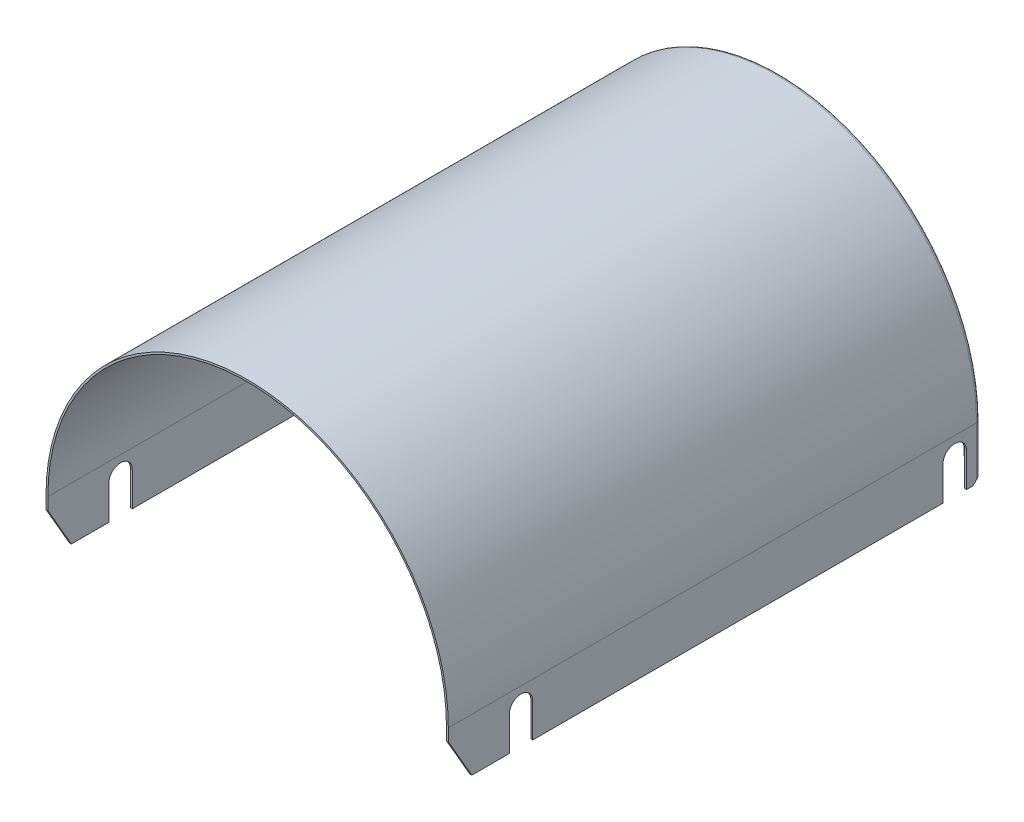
ISO-10303-21;
HEADER;
FILE_DESCRIPTION(('STEP AP214'),'2;1');
FILE_NAME('part.step','',(''),(''),'','','');
FILE_SCHEMA(('AUTOMOTIVE_DESIGN { 1 0 10303 214 1 1 1 1 }'));
ENDSEC;
DATA;
#1=APPLICATION_CONTEXT('core data for automotive mechanical design processes');
#2=APPLICATION_PROTOCOL_DEFINITION('international standard','automotive_design',2000,#1);
#3=PRODUCT_CONTEXT('',#1,'mechanical');
#4=PRODUCT('Part','Part','',(#3));
#5=PRODUCT_RELATED_PRODUCT_CATEGORY('part','',(#4));
#6=PRODUCT_DEFINITION_FORMATION('','',#4);
#7=PRODUCT_DEFINITION_CONTEXT('part definition',#1,'design');
#8=PRODUCT_DEFINITION('design','',#6,#7);
#9=PRODUCT_DEFINITION_SHAPE('','',#8);
#10=(LENGTH_UNIT() NAMED_UNIT(*) SI_UNIT(.MILLI.,.METRE.));
#11=(NAMED_UNIT(*) PLANE_ANGLE_UNIT() SI_UNIT($,.RADIAN.));
#12=(NAMED_UNIT(*) SI_UNIT($,.STERADIAN.) SOLID_ANGLE_UNIT());
#13=UNCERTAINTY_MEASURE_WITH_UNIT(LENGTH_MEASURE(1.E-05),#10,'distance_accuracy_value','');
#14=(GEOMETRIC_REPRESENTATION_CONTEXT(3) GLOBAL_UNCERTAINTY_ASSIGNED_CONTEXT((#13)) GLOBAL_UNIT_ASSIGNED_CONTEXT((#10,
#11,#12)) REPRESENTATION_CONTEXT('',''));
#15=CARTESIAN_POINT('',(0.,0.,0.));
#16=DIRECTION('',(0.,0.,1.));
#17=DIRECTION('',(1.,0.,0.));
#18=AXIS2_PLACEMENT_3D('',#15,#16,#17);
#19=CARTESIAN_POINT('',(0.,0.,0.));
#20=DIRECTION('',(0.,0.,1.));
#21=DIRECTION('',(1.,0.,0.));
#22=AXIS2_PLACEMENT_3D('',#19,#20,#21);
#23=PLANE('',#22);
#24=DIRECTION('',(0.,1.,0.));
#25=VECTOR('',#24,1.);
#26=CARTESIAN_POINT('',(-84.3,-22.5,0.));
#27=LINE('',#26,#25);
#28=CARTESIAN_POINT('',(-84.3,0.,0.));
#29=VERTEX_POINT('',#28);
#30=CARTESIAN_POINT('',(-84.3,-20.3,0.));
#31=VERTEX_POINT('',#30);
#32=EDGE_CURVE('E470',#29,#31,#27,.F.);
#33=ORIENTED_EDGE('',*,*,#32,.T.);
#34=DIRECTION('',(0.683941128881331,0.729537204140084,0.));
#35=VECTOR('',#34,1.);
#36=CARTESIAN_POINT('',(-34.7376299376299,32.566528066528,0.));
#37=LINE('',#36,#35);
#38=CARTESIAN_POINT('',(-79.8,-15.5,0.));
#39=VERTEX_POINT('',#38);
#40=EDGE_CURVE('E288',#31,#39,#37,.T.);
#41=ORIENTED_EDGE('',*,*,#40,.T.);
#42=DIRECTION('',(0.,1.,0.));
#43=VECTOR('',#42,1.);
#44=CARTESIAN_POINT('',(-79.8,-22.5,0.));
#45=LINE('',#44,#43);
#46=CARTESIAN_POINT('',(-79.8,0.,0.));
#47=VERTEX_POINT('',#46);
#48=EDGE_CURVE('E287',#39,#47,#45,.T.);
#49=ORIENTED_EDGE('',*,*,#48,.T.);
#50=CARTESIAN_POINT('',(0.,0.,0.));
#51=DIRECTION('',(0.,0.,-1.));
#52=DIRECTION('',(1.,0.,0.));
#53=AXIS2_PLACEMENT_3D('',#50,#51,#52);
#54=CIRCLE('',#53,79.8);
#55=CARTESIAN_POINT('',(79.8,0.,0.));
#56=VERTEX_POINT('',#55);
#57=EDGE_CURVE('E300',#47,#56,#54,.T.);
#58=ORIENTED_EDGE('',*,*,#57,.T.);
#59=DIRECTION('',(0.,-1.,0.));
#60=VECTOR('',#59,1.);
#61=CARTESIAN_POINT('',(79.8,-22.5,0.));
#62=LINE('',#61,#60);
#63=CARTESIAN_POINT('',(79.8,-15.5,0.));
#64=VERTEX_POINT('',#63);
#65=EDGE_CURVE('E295',#56,#64,#62,.T.);
#66=ORIENTED_EDGE('',*,*,#65,.T.);
#67=DIRECTION('',(-0.683941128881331,0.729537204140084,0.));
#68=VECTOR('',#67,1.);
#69=CARTESIAN_POINT('',(34.7376299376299,32.566528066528,0.));
#70=LINE('',#69,#68);
#71=CARTESIAN_POINT('',(84.3,-20.3,0.));
#72=VERTEX_POINT('',#71);
#73=EDGE_CURVE('E535',#72,#64,#70,.T.);
#74=ORIENTED_EDGE('',*,*,#73,.F.);
#75=DIRECTION('',(0.,1.,0.));
#76=VECTOR('',#75,1.);
#77=CARTESIAN_POINT('',(84.3,0.,0.));
#78=LINE('',#77,#76);
#79=CARTESIAN_POINT('',(84.3,0.,0.));
#80=VERTEX_POINT('',#79);
#81=EDGE_CURVE('E468',#72,#80,#78,.T.);
#82=ORIENTED_EDGE('',*,*,#81,.T.);
#83=CARTESIAN_POINT('',(0.,0.,0.));
#84=DIRECTION('',(0.,0.,1.));
#85=DIRECTION('',(1.,0.,0.));
#86=AXIS2_PLACEMENT_3D('',#83,#84,#85);
#87=CIRCLE('',#86,84.3);
#88=EDGE_CURVE('E466',#80,#29,#87,.T.);
#89=ORIENTED_EDGE('',*,*,#88,.T.);
#90=EDGE_LOOP('',(#33,#41,#49,#58,#66,#74,#82,#89));
#91=FACE_BOUND('',#90,.T.);
#92=ADVANCED_FACE('F32',(#91),#23,.T.);
#93=CARTESIAN_POINT('',(-79.8,-22.5,-0.799999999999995));
#94=DIRECTION('',(1.,0.,0.));
#95=DIRECTION('',(0.,0.,-1.));
#96=AXIS2_PLACEMENT_3D('',#93,#94,#95);
#97=PLANE('',#96);
#98=ORIENTED_EDGE('',*,*,#48,.F.);
#99=DIRECTION('',(0.,0.,-1.));
#100=VECTOR('',#99,1.);
#101=CARTESIAN_POINT('',(-79.8,-15.5,226.));
#102=LINE('',#101,#100);
#103=CARTESIAN_POINT('',(-79.8,-15.5,-0.799999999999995));
#104=VERTEX_POINT('',#103);
#105=EDGE_CURVE('E273',#39,#104,#102,.T.);
#106=ORIENTED_EDGE('',*,*,#105,.T.);
#107=DIRECTION('',(0.,1.,0.));
#108=VECTOR('',#107,1.);
#109=CARTESIAN_POINT('',(-79.8,-22.5,-0.799999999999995));
#110=LINE('',#109,#108);
#111=CARTESIAN_POINT('',(-79.8,0.,-0.799999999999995));
#112=VERTEX_POINT('',#111);
#113=EDGE_CURVE('E285',#104,#112,#110,.T.);
#114=ORIENTED_EDGE('',*,*,#113,.T.);
#115=DIRECTION('',(0.,0.,1.));
#116=VECTOR('',#115,1.);
#117=CARTESIAN_POINT('',(-79.8,0.,-0.799999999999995));
#118=LINE('',#117,#116);
#119=EDGE_CURVE('E308',#112,#47,#118,.T.);
#120=ORIENTED_EDGE('',*,*,#119,.T.);
#121=EDGE_LOOP('',(#98,#106,#114,#120));
#122=FACE_BOUND('',#121,.T.);
#123=ADVANCED_FACE('F283',(#122),#97,.T.);
#124=CARTESIAN_POINT('',(0.,0.,-0.799999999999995));
#125=DIRECTION('',(0.,0.,1.));
#126=DIRECTION('',(1.,0.,0.));
#127=AXIS2_PLACEMENT_3D('',#124,#125,#126);
#128=PLANE('',#127);
#129=DIRECTION('',(-0.68394112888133,-0.729537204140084,0.));
#130=VECTOR('',#129,1.);
#131=CARTESIAN_POINT('',(-84.3,-20.3,-0.799999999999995));
#132=LINE('',#131,#130);
#133=CARTESIAN_POINT('',(-83.55,-19.5,-0.799999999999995));
#134=VERTEX_POINT('',#133);
#135=EDGE_CURVE('E270',#104,#134,#132,.T.);
#136=ORIENTED_EDGE('',*,*,#135,.T.);
#137=DIRECTION('',(1.,0.,0.));
#138=VECTOR('',#137,1.);
#139=CARTESIAN_POINT('',(-85.8,-19.5,-0.799999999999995));
#140=LINE('',#139,#138);
#141=CARTESIAN_POINT('',(-84.3,-19.5,-0.799999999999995));
#142=VERTEX_POINT('',#141);
#143=EDGE_CURVE('E493',#142,#134,#140,.T.);
#144=ORIENTED_EDGE('',*,*,#143,.F.);
#145=DIRECTION('',(0.,-1.,0.));
#146=VECTOR('',#145,1.);
#147=CARTESIAN_POINT('',(-84.3,0.,-0.799999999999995));
#148=LINE('',#147,#146);
#149=CARTESIAN_POINT('',(-84.3,0.,-0.799999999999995));
#150=VERTEX_POINT('',#149);
#151=EDGE_CURVE('E448',#142,#150,#148,.F.);
#152=ORIENTED_EDGE('',*,*,#151,.T.);
#153=CARTESIAN_POINT('',(0.,0.,-0.799999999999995));
#154=DIRECTION('',(0.,0.,1.));
#155=DIRECTION('',(1.,0.,0.));
#156=AXIS2_PLACEMENT_3D('',#153,#154,#155);
#157=CIRCLE('',#156,84.3);
#158=CARTESIAN_POINT('',(84.3,0.,-0.800000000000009));
#159=VERTEX_POINT('',#158);
#160=EDGE_CURVE('E445',#150,#159,#157,.F.);
#161=ORIENTED_EDGE('',*,*,#160,.T.);
#162=DIRECTION('',(0.,1.,0.));
#163=VECTOR('',#162,1.);
#164=CARTESIAN_POINT('',(84.3,0.,-0.800000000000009));
#165=LINE('',#164,#163);
#166=CARTESIAN_POINT('',(84.3,-19.5,-0.800000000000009));
#167=VERTEX_POINT('',#166);
#168=EDGE_CURVE('E450',#159,#167,#165,.F.);
#169=ORIENTED_EDGE('',*,*,#168,.T.);
#170=CARTESIAN_POINT('',(83.55,-19.5,-0.800000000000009));
#171=VERTEX_POINT('',#170);
#172=EDGE_CURVE('E487',#171,#167,#140,.T.);
#173=ORIENTED_EDGE('',*,*,#172,.F.);
#174=DIRECTION('',(0.68394112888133,-0.729537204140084,0.));
#175=VECTOR('',#174,1.);
#176=CARTESIAN_POINT('',(84.3,-20.3,-0.800000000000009));
#177=LINE('',#176,#175);
#178=CARTESIAN_POINT('',(79.8,-15.5,-0.800000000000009));
#179=VERTEX_POINT('',#178);
#180=EDGE_CURVE('E47',#179,#171,#177,.T.);
#181=ORIENTED_EDGE('',*,*,#180,.F.);
#182=DIRECTION('',(0.,-1.,0.));
#183=VECTOR('',#182,1.);
#184=CARTESIAN_POINT('',(79.8,-22.5,-0.800000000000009));
#185=LINE('',#184,#183);
#186=CARTESIAN_POINT('',(79.8,0.,-0.800000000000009));
#187=VERTEX_POINT('',#186);
#188=EDGE_CURVE('E297',#187,#179,#185,.T.);
#189=ORIENTED_EDGE('',*,*,#188,.F.);
#190=CARTESIAN_POINT('',(0.,0.,-0.799999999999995));
#191=DIRECTION('',(0.,0.,-1.));
#192=DIRECTION('',(1.,0.,0.));
#193=AXIS2_PLACEMENT_3D('',#190,#191,#192);
#194=CIRCLE('',#193,79.8);
#195=EDGE_CURVE('E294',#112,#187,#194,.T.);
#196=ORIENTED_EDGE('',*,*,#195,.F.);
#197=ORIENTED_EDGE('',*,*,#113,.F.);
#198=EDGE_LOOP('',(#136,#144,#152,#161,#169,#173,#181,#189,#196,#197));
#199=FACE_BOUND('',#198,.T.);
#200=ADVANCED_FACE('F291',(#199),#128,.F.);
#201=CARTESIAN_POINT('',(-85.8,-19.5,-0.799999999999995));
#202=DIRECTION('',(0.,0.707106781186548,0.707106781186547));
#203=DIRECTION('',(0.,-0.707106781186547,0.707106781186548));
#204=AXIS2_PLACEMENT_3D('',#201,#202,#203);
#205=PLANE('',#204);
#206=DIRECTION('',(0.552532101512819,0.589367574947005,-0.589367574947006));
#207=VECTOR('',#206,1.);
#208=CARTESIAN_POINT('',(-84.2369063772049,-20.2327001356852,-0.0672998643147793));
#209=LINE('',#208,#207);
#210=EDGE_CURVE('E11',#31,#134,#209,.T.);
#211=ORIENTED_EDGE('',*,*,#210,.F.);
#212=CARTESIAN_POINT('',(-84.3,-21.,0.700000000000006));
#213=DIRECTION('',(0.,0.707106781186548,0.707106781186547));
#214=DIRECTION('',(0.,-0.707106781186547,0.707106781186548));
#215=AXIS2_PLACEMENT_3D('',#212,#213,#214);
#216=ELLIPSE('',#215,0.989949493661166,0.7);
#217=CARTESIAN_POINT('',(-85.,-21.,0.700000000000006));
#218=VERTEX_POINT('',#217);
#219=EDGE_CURVE('E478',#218,#31,#216,.F.);
#220=ORIENTED_EDGE('',*,*,#219,.F.);
#221=DIRECTION('',(0.,-0.707106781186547,0.707106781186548));
#222=VECTOR('',#221,1.);
#223=CARTESIAN_POINT('',(-85.,-134.4,114.1));
#224=LINE('',#223,#222);
#225=CARTESIAN_POINT('',(-85.,-22.5,2.20000000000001));
#226=VERTEX_POINT('',#225);
#227=EDGE_CURVE('E503',#218,#226,#224,.T.);
#228=ORIENTED_EDGE('',*,*,#227,.T.);
#229=DIRECTION('',(1.,0.,0.));
#230=VECTOR('',#229,1.);
#231=CARTESIAN_POINT('',(-85.8,-22.5,2.20000000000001));
#232=LINE('',#231,#230);
#233=CARTESIAN_POINT('',(-85.8,-22.5,2.20000000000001));
#234=VERTEX_POINT('',#233);
#235=EDGE_CURVE('E502',#234,#226,#232,.T.);
#236=ORIENTED_EDGE('',*,*,#235,.F.);
#237=DIRECTION('',(0.,-0.707106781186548,0.707106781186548));
#238=VECTOR('',#237,1.);
#239=CARTESIAN_POINT('',(-85.8,-19.5,-0.799999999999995));
#240=LINE('',#239,#238);
#241=CARTESIAN_POINT('',(-85.8,-21.,0.700000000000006));
#242=VERTEX_POINT('',#241);
#243=EDGE_CURVE('E494',#242,#234,#240,.T.);
#244=ORIENTED_EDGE('',*,*,#243,.F.);
#245=CARTESIAN_POINT('',(-84.3,-21.,0.700000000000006));
#246=DIRECTION('',(0.,0.707106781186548,0.707106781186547));
#247=DIRECTION('',(0.,0.707106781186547,-0.707106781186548));
#248=AXIS2_PLACEMENT_3D('',#245,#246,#247);
#249=ELLIPSE('',#248,2.12132034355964,1.5);
#250=EDGE_CURVE('E303',#242,#142,#249,.F.);
#251=ORIENTED_EDGE('',*,*,#250,.T.);
#252=ORIENTED_EDGE('',*,*,#143,.T.);
#253=EDGE_LOOP('',(#211,#220,#228,#236,#244,#251,#252));
#254=FACE_BOUND('',#253,.T.);
#255=ADVANCED_FACE('F510',(#254),#205,.F.);
#256=CARTESIAN_POINT('',(85.,-22.5,0.));
#257=DIRECTION('',(0.,-1.,0.));
#258=DIRECTION('',(1.,0.,0.));
#259=AXIS2_PLACEMENT_3D('',#256,#257,#258);
#260=PLANE('',#259);
#261=DIRECTION('',(1.,0.,0.));
#262=VECTOR('',#261,1.);
#263=CARTESIAN_POINT('',(-85.8,-22.5,15.));
#264=LINE('',#263,#262);
#265=CARTESIAN_POINT('',(85.,-22.5,15.));
#266=VERTEX_POINT('',#265);
#267=CARTESIAN_POINT('',(85.8,-22.5,15.));
#268=VERTEX_POINT('',#267);
#269=EDGE_CURVE('E355',#266,#268,#264,.T.);
#270=ORIENTED_EDGE('',*,*,#269,.T.);
#271=DIRECTION('',(0.,0.,1.));
#272=VECTOR('',#271,1.);
#273=CARTESIAN_POINT('',(85.8,-22.5,0.));
#274=LINE('',#273,#272);
#275=CARTESIAN_POINT('',(85.8,-22.5,190.));
#276=VERTEX_POINT('',#275);
#277=EDGE_CURVE('E894',#268,#276,#274,.T.);
#278=ORIENTED_EDGE('',*,*,#277,.T.);
#279=DIRECTION('',(1.,0.,0.));
#280=VECTOR('',#279,1.);
#281=CARTESIAN_POINT('',(-85.8,-22.5,190.));
#282=LINE('',#281,#280);
#283=CARTESIAN_POINT('',(85.,-22.5,190.));
#284=VERTEX_POINT('',#283);
#285=EDGE_CURVE('E397',#284,#276,#282,.T.);
#286=ORIENTED_EDGE('',*,*,#285,.F.);
#287=DIRECTION('',(0.,0.,-1.));
#288=VECTOR('',#287,1.);
#289=CARTESIAN_POINT('',(85.,-22.5,226.));
#290=LINE('',#289,#288);
#291=EDGE_CURVE('E891',#284,#266,#290,.T.);
#292=ORIENTED_EDGE('',*,*,#291,.T.);
#293=EDGE_LOOP('',(#270,#278,#286,#292));
#294=FACE_BOUND('',#293,.T.);
#295=ADVANCED_FACE('F608',(#294),#260,.T.);
#296=CARTESIAN_POINT('',(-85.,-22.5,0.));
#297=DIRECTION('',(0.,-1.,0.));
#298=DIRECTION('',(-1.,0.,0.));
#299=AXIS2_PLACEMENT_3D('',#296,#297,#298);
#300=PLANE('',#299);
#301=CARTESIAN_POINT('',(-85.8,-22.5,15.));
#302=VERTEX_POINT('',#301);
#303=CARTESIAN_POINT('',(-85.,-22.5,15.));
#304=VERTEX_POINT('',#303);
#305=EDGE_CURVE('E351',#302,#304,#264,.T.);
#306=ORIENTED_EDGE('',*,*,#305,.T.);
#307=DIRECTION('',(0.,0.,-1.));
#308=VECTOR('',#307,1.);
#309=CARTESIAN_POINT('',(-85.,-22.5,226.));
#310=LINE('',#309,#308);
#311=CARTESIAN_POINT('',(-85.,-22.5,190.));
#312=VERTEX_POINT('',#311);
#313=EDGE_CURVE('E433',#312,#304,#310,.T.);
#314=ORIENTED_EDGE('',*,*,#313,.F.);
#315=CARTESIAN_POINT('',(-85.8,-22.5,190.));
#316=VERTEX_POINT('',#315);
#317=EDGE_CURVE('E411',#316,#312,#282,.T.);
#318=ORIENTED_EDGE('',*,*,#317,.F.);
#319=DIRECTION('',(0.,0.,1.));
#320=VECTOR('',#319,1.);
#321=CARTESIAN_POINT('',(-85.8,-22.5,0.));
#322=LINE('',#321,#320);
#323=EDGE_CURVE('E886',#302,#316,#322,.T.);
#324=ORIENTED_EDGE('',*,*,#323,.F.);
#325=EDGE_LOOP('',(#306,#314,#318,#324));
#326=FACE_BOUND('',#325,.T.);
#327=ADVANCED_FACE('F674',(#326),#300,.T.);
#328=DIRECTION('',(1.,0.,0.));
#329=VECTOR('',#328,1.);
#330=CARTESIAN_POINT('',(-85.8,-22.5,216.));
#331=LINE('',#330,#329);
#332=CARTESIAN_POINT('',(85.,-22.5,216.));
#333=VERTEX_POINT('',#332);
#334=CARTESIAN_POINT('',(85.8,-22.5,216.));
#335=VERTEX_POINT('',#334);
#336=EDGE_CURVE('E325',#333,#335,#331,.T.);
#337=ORIENTED_EDGE('',*,*,#336,.F.);
#338=CARTESIAN_POINT('',(85.,-22.5,200.));
#339=VERTEX_POINT('',#338);
#340=EDGE_CURVE('E887',#333,#339,#290,.T.);
#341=ORIENTED_EDGE('',*,*,#340,.T.);
#342=DIRECTION('',(1.,0.,0.));
#343=VECTOR('',#342,1.);
#344=CARTESIAN_POINT('',(-85.8,-22.5,200.));
#345=LINE('',#344,#343);
#346=CARTESIAN_POINT('',(85.8,-22.5,200.));
#347=VERTEX_POINT('',#346);
#348=EDGE_CURVE('E402',#339,#347,#345,.T.);
#349=ORIENTED_EDGE('',*,*,#348,.T.);
#350=EDGE_CURVE('E890',#347,#335,#274,.T.);
#351=ORIENTED_EDGE('',*,*,#350,.T.);
#352=EDGE_LOOP('',(#337,#341,#349,#351));
#353=FACE_BOUND('',#352,.T.);
#354=ADVANCED_FACE('F699',(#353),#260,.T.);
#355=CARTESIAN_POINT('',(-85.8,-22.5,216.));
#356=VERTEX_POINT('',#355);
#357=CARTESIAN_POINT('',(-85.,-22.5,216.));
#358=VERTEX_POINT('',#357);
#359=EDGE_CURVE('E322',#356,#358,#331,.T.);
#360=ORIENTED_EDGE('',*,*,#359,.F.);
#361=CARTESIAN_POINT('',(-85.8,-22.5,200.));
#362=VERTEX_POINT('',#361);
#363=EDGE_CURVE('E432',#362,#356,#322,.T.);
#364=ORIENTED_EDGE('',*,*,#363,.F.);
#365=CARTESIAN_POINT('',(-85.,-22.5,200.));
#366=VERTEX_POINT('',#365);
#367=EDGE_CURVE('E398',#362,#366,#345,.T.);
#368=ORIENTED_EDGE('',*,*,#367,.T.);
#369=EDGE_CURVE('E429',#358,#366,#310,.T.);
#370=ORIENTED_EDGE('',*,*,#369,.F.);
#371=EDGE_LOOP('',(#360,#364,#368,#370));
#372=FACE_BOUND('',#371,.T.);
#373=ADVANCED_FACE('F675',(#372),#300,.T.);
#374=CARTESIAN_POINT('',(0.,0.,226.));
#375=DIRECTION('',(0.,0.,-1.));
#376=DIRECTION('',(-1.,0.,0.));
#377=AXIS2_PLACEMENT_3D('',#374,#375,#376);
#378=CYLINDRICAL_SURFACE('',#377,85.);
#379=DIRECTION('',(0.,0.,-1.));
#380=VECTOR('',#379,1.);
#381=CARTESIAN_POINT('',(-85.,0.,226.));
#382=LINE('',#381,#380);
#383=CARTESIAN_POINT('',(-85.,0.,226.));
#384=VERTEX_POINT('',#383);
#385=CARTESIAN_POINT('',(-85.,0.,0.700000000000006));
#386=VERTEX_POINT('',#385);
#387=EDGE_CURVE('E555',#384,#386,#382,.T.);
#388=ORIENTED_EDGE('',*,*,#387,.T.);
#389=CARTESIAN_POINT('',(0.,0.,0.700000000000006));
#390=DIRECTION('',(0.,0.,1.));
#391=DIRECTION('',(1.,0.,0.));
#392=AXIS2_PLACEMENT_3D('',#389,#390,#391);
#393=CIRCLE('',#392,85.);
#394=CARTESIAN_POINT('',(85.,0.,0.700000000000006));
#395=VERTEX_POINT('',#394);
#396=EDGE_CURVE('E476',#386,#395,#393,.F.);
#397=ORIENTED_EDGE('',*,*,#396,.T.);
#398=DIRECTION('',(0.,0.,-1.));
#399=VECTOR('',#398,1.);
#400=CARTESIAN_POINT('',(85.,0.,226.));
#401=LINE('',#400,#399);
#402=CARTESIAN_POINT('',(85.,0.,226.));
#403=VERTEX_POINT('',#402);
#404=EDGE_CURVE('E446',#403,#395,#401,.T.);
#405=ORIENTED_EDGE('',*,*,#404,.F.);
#406=CARTESIAN_POINT('',(0.,0.,226.));
#407=DIRECTION('',(0.,0.,-1.));
#408=DIRECTION('',(-1.,0.,0.));
#409=AXIS2_PLACEMENT_3D('',#406,#407,#408);
#410=CIRCLE('',#409,85.);
#411=EDGE_CURVE('E898',#384,#403,#410,.T.);
#412=ORIENTED_EDGE('',*,*,#411,.F.);
#413=EDGE_LOOP('',(#388,#397,#405,#412));
#414=FACE_BOUND('',#413,.T.);
#415=ADVANCED_FACE('F722',(#414),#378,.F.);
#416=CARTESIAN_POINT('',(0.,0.,226.));
#417=DIRECTION('',(0.,0.,-1.));
#418=DIRECTION('',(-1.,0.,0.));
#419=AXIS2_PLACEMENT_3D('',#416,#417,#418);
#420=CYLINDRICAL_SURFACE('',#419,85.8);
#421=DIRECTION('',(0.,0.,-1.));
#422=VECTOR('',#421,1.);
#423=CARTESIAN_POINT('',(85.8,0.,226.));
#424=LINE('',#423,#422);
#425=CARTESIAN_POINT('',(85.8,0.,226.));
#426=VERTEX_POINT('',#425);
#427=CARTESIAN_POINT('',(85.8,0.,0.700000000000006));
#428=VERTEX_POINT('',#427);
#429=EDGE_CURVE('E530',#426,#428,#424,.T.);
#430=ORIENTED_EDGE('',*,*,#429,.T.);
#431=CARTESIAN_POINT('',(0.,0.,0.700000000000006));
#432=DIRECTION('',(0.,0.,1.));
#433=DIRECTION('',(1.,0.,0.));
#434=AXIS2_PLACEMENT_3D('',#431,#432,#433);
#435=CIRCLE('',#434,85.8);
#436=CARTESIAN_POINT('',(-85.8,0.,0.700000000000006));
#437=VERTEX_POINT('',#436);
#438=EDGE_CURVE('E456',#428,#437,#435,.T.);
#439=ORIENTED_EDGE('',*,*,#438,.T.);
#440=DIRECTION('',(0.,0.,-1.));
#441=VECTOR('',#440,1.);
#442=CARTESIAN_POINT('',(-85.8,0.,226.));
#443=LINE('',#442,#441);
#444=CARTESIAN_POINT('',(-85.8,0.,226.));
#445=VERTEX_POINT('',#444);
#446=EDGE_CURVE('E903',#445,#437,#443,.T.);
#447=ORIENTED_EDGE('',*,*,#446,.F.);
#448=CARTESIAN_POINT('',(0.,0.,226.));
#449=DIRECTION('',(0.,0.,1.));
#450=DIRECTION('',(1.,0.,0.));
#451=AXIS2_PLACEMENT_3D('',#448,#449,#450);
#452=CIRCLE('',#451,85.8);
#453=EDGE_CURVE('E881',#445,#426,#452,.F.);
#454=ORIENTED_EDGE('',*,*,#453,.T.);
#455=EDGE_LOOP('',(#430,#439,#447,#454));
#456=FACE_BOUND('',#455,.T.);
#457=ADVANCED_FACE('F715',(#456),#420,.T.);
#458=CARTESIAN_POINT('',(0.,0.,226.));
#459=DIRECTION('',(0.,0.,-1.));
#460=DIRECTION('',(-1.,0.,0.));
#461=AXIS2_PLACEMENT_3D('',#458,#459,#460);
#462=PLANE('',#461);
#463=DIRECTION('',(0.,1.,0.));
#464=VECTOR('',#463,1.);
#465=CARTESIAN_POINT('',(-85.8,-22.5,226.));
#466=LINE('',#465,#464);
#467=CARTESIAN_POINT('',(-85.8,-5.17949192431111,226.));
#468=VERTEX_POINT('',#467);
#469=EDGE_CURVE('E880',#468,#445,#466,.T.);
#470=ORIENTED_EDGE('',*,*,#469,.F.);
#471=DIRECTION('',(1.,0.,0.));
#472=VECTOR('',#471,1.);
#473=CARTESIAN_POINT('',(-85.8,-5.17949192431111,226.));
#474=LINE('',#473,#472);
#475=CARTESIAN_POINT('',(-85.,-5.17949192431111,226.));
#476=VERTEX_POINT('',#475);
#477=EDGE_CURVE('E326',#468,#476,#474,.T.);
#478=ORIENTED_EDGE('',*,*,#477,.T.);
#479=DIRECTION('',(0.,1.,0.));
#480=VECTOR('',#479,1.);
#481=CARTESIAN_POINT('',(-85.,-22.5,226.));
#482=LINE('',#481,#480);
#483=EDGE_CURVE('E884',#476,#384,#482,.T.);
#484=ORIENTED_EDGE('',*,*,#483,.T.);
#485=ORIENTED_EDGE('',*,*,#411,.T.);
#486=DIRECTION('',(0.,1.,0.));
#487=VECTOR('',#486,1.);
#488=CARTESIAN_POINT('',(85.,-22.5,226.));
#489=LINE('',#488,#487);
#490=CARTESIAN_POINT('',(85.,-5.17949192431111,226.));
#491=VERTEX_POINT('',#490);
#492=EDGE_CURVE('E893',#491,#403,#489,.T.);
#493=ORIENTED_EDGE('',*,*,#492,.F.);
#494=CARTESIAN_POINT('',(85.8,-5.17949192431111,226.));
#495=VERTEX_POINT('',#494);
#496=EDGE_CURVE('E321',#491,#495,#474,.T.);
#497=ORIENTED_EDGE('',*,*,#496,.T.);
#498=DIRECTION('',(0.,1.,0.));
#499=VECTOR('',#498,1.);
#500=CARTESIAN_POINT('',(85.8,-22.5,226.));
#501=LINE('',#500,#499);
#502=EDGE_CURVE('E896',#495,#426,#501,.T.);
#503=ORIENTED_EDGE('',*,*,#502,.T.);
#504=ORIENTED_EDGE('',*,*,#453,.F.);
#505=EDGE_LOOP('',(#470,#478,#484,#485,#493,#497,#503,#504));
#506=FACE_BOUND('',#505,.T.);
#507=ADVANCED_FACE('F721',(#506),#462,.F.);
#508=CARTESIAN_POINT('',(85.,-22.5,226.));
#509=DIRECTION('',(1.,0.,0.));
#510=DIRECTION('',(0.,1.,0.));
#511=AXIS2_PLACEMENT_3D('',#508,#509,#510);
#512=PLANE('',#511);
#513=DIRECTION('',(0.,1.,0.));
#514=VECTOR('',#513,1.);
#515=CARTESIAN_POINT('',(85.,-22.5,0.700000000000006));
#516=LINE('',#515,#514);
#517=CARTESIAN_POINT('',(85.,-21.,0.700000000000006));
#518=VERTEX_POINT('',#517);
#519=EDGE_CURVE('E473',#395,#518,#516,.F.);
#520=ORIENTED_EDGE('',*,*,#519,.T.);
#521=DIRECTION('',(0.,-0.707106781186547,0.707106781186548));
#522=VECTOR('',#521,1.);
#523=CARTESIAN_POINT('',(85.,-134.4,114.1));
#524=LINE('',#523,#522);
#525=CARTESIAN_POINT('',(85.,-22.5,2.19999999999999));
#526=VERTEX_POINT('',#525);
#527=EDGE_CURVE('E55',#518,#526,#524,.T.);
#528=ORIENTED_EDGE('',*,*,#527,.T.);
#529=CARTESIAN_POINT('',(85.,-22.5,5.));
#530=VERTEX_POINT('',#529);
#531=EDGE_CURVE('E440',#530,#526,#290,.T.);
#532=ORIENTED_EDGE('',*,*,#531,.F.);
#533=DIRECTION('',(0.,1.,0.));
#534=VECTOR('',#533,1.);
#535=CARTESIAN_POINT('',(85.,-22.5,5.));
#536=LINE('',#535,#534);
#537=CARTESIAN_POINT('',(85.,-8.00000000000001,5.));
#538=VERTEX_POINT('',#537);
#539=EDGE_CURVE('E367',#530,#538,#536,.T.);
#540=ORIENTED_EDGE('',*,*,#539,.T.);
#541=CARTESIAN_POINT('',(85.,-8.00000000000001,10.));
#542=DIRECTION('',(1.,0.,0.));
#543=DIRECTION('',(0.,1.,0.));
#544=AXIS2_PLACEMENT_3D('',#541,#542,#543);
#545=CIRCLE('',#544,5.);
#546=CARTESIAN_POINT('',(85.,-8.00000000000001,15.));
#547=VERTEX_POINT('',#546);
#548=EDGE_CURVE('E377',#538,#547,#545,.T.);
#549=ORIENTED_EDGE('',*,*,#548,.T.);
#550=DIRECTION('',(0.,-1.,0.));
#551=VECTOR('',#550,1.);
#552=CARTESIAN_POINT('',(85.,-22.5,15.));
#553=LINE('',#552,#551);
#554=EDGE_CURVE('E372',#547,#266,#553,.T.);
#555=ORIENTED_EDGE('',*,*,#554,.T.);
#556=ORIENTED_EDGE('',*,*,#291,.F.);
#557=DIRECTION('',(0.,1.,0.));
#558=VECTOR('',#557,1.);
#559=CARTESIAN_POINT('',(85.,-22.5,190.));
#560=LINE('',#559,#558);
#561=CARTESIAN_POINT('',(85.,-8.00000000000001,190.));
#562=VERTEX_POINT('',#561);
#563=EDGE_CURVE('E414',#284,#562,#560,.T.);
#564=ORIENTED_EDGE('',*,*,#563,.T.);
#565=CARTESIAN_POINT('',(85.,-8.00000000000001,195.));
#566=DIRECTION('',(1.,0.,0.));
#567=DIRECTION('',(0.,1.,0.));
#568=AXIS2_PLACEMENT_3D('',#565,#566,#567);
#569=CIRCLE('',#568,5.);
#570=CARTESIAN_POINT('',(85.,-8.00000000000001,200.));
#571=VERTEX_POINT('',#570);
#572=EDGE_CURVE('E425',#562,#571,#569,.T.);
#573=ORIENTED_EDGE('',*,*,#572,.T.);
#574=DIRECTION('',(0.,-1.,0.));
#575=VECTOR('',#574,1.);
#576=CARTESIAN_POINT('',(85.,-22.5,200.));
#577=LINE('',#576,#575);
#578=EDGE_CURVE('E420',#571,#339,#577,.T.);
#579=ORIENTED_EDGE('',*,*,#578,.T.);
#580=ORIENTED_EDGE('',*,*,#340,.F.);
#581=DIRECTION('',(0.,0.86602540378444,0.499999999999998));
#582=VECTOR('',#581,1.);
#583=CARTESIAN_POINT('',(85.,-18.1698729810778,218.5));
#584=LINE('',#583,#582);
#585=EDGE_CURVE('E330',#333,#491,#584,.T.);
#586=ORIENTED_EDGE('',*,*,#585,.T.);
#587=ORIENTED_EDGE('',*,*,#492,.T.);
#588=ORIENTED_EDGE('',*,*,#404,.T.);
#589=EDGE_LOOP('',(#520,#528,#532,#540,#549,#555,#556,#564,#573,#579,#580,#586,#587,#588));
#590=FACE_BOUND('',#589,.T.);
#591=ADVANCED_FACE('F571',(#590),#512,.F.);
#592=CARTESIAN_POINT('',(85.8,-22.5,0.));
#593=DIRECTION('',(-1.,0.,0.));
#594=DIRECTION('',(0.,-1.,0.));
#595=AXIS2_PLACEMENT_3D('',#592,#593,#594);
#596=PLANE('',#595);
#597=CARTESIAN_POINT('',(85.8,-22.5,2.19999999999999));
#598=VERTEX_POINT('',#597);
#599=CARTESIAN_POINT('',(85.8,-22.5,5.));
#600=VERTEX_POINT('',#599);
#601=EDGE_CURVE('E533',#598,#600,#274,.T.);
#602=ORIENTED_EDGE('',*,*,#601,.F.);
#603=DIRECTION('',(0.,-0.707106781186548,0.707106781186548));
#604=VECTOR('',#603,1.);
#605=CARTESIAN_POINT('',(85.8,-19.5,-0.800000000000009));
#606=LINE('',#605,#604);
#607=CARTESIAN_POINT('',(85.8,-21.,0.699999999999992));
#608=VERTEX_POINT('',#607);
#609=EDGE_CURVE('E498',#608,#598,#606,.T.);
#610=ORIENTED_EDGE('',*,*,#609,.F.);
#611=DIRECTION('',(0.,1.,0.));
#612=VECTOR('',#611,1.);
#613=CARTESIAN_POINT('',(85.8,-22.5,0.699999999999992));
#614=LINE('',#613,#612);
#615=EDGE_CURVE('E443',#608,#428,#614,.T.);
#616=ORIENTED_EDGE('',*,*,#615,.T.);
#617=ORIENTED_EDGE('',*,*,#429,.F.);
#618=ORIENTED_EDGE('',*,*,#502,.F.);
#619=DIRECTION('',(0.,0.86602540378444,0.499999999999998));
#620=VECTOR('',#619,1.);
#621=CARTESIAN_POINT('',(85.8,-22.5,216.));
#622=LINE('',#621,#620);
#623=EDGE_CURVE('E315',#335,#495,#622,.T.);
#624=ORIENTED_EDGE('',*,*,#623,.F.);
#625=ORIENTED_EDGE('',*,*,#350,.F.);
#626=DIRECTION('',(0.,-1.,0.));
#627=VECTOR('',#626,1.);
#628=CARTESIAN_POINT('',(85.8,-22.5,200.));
#629=LINE('',#628,#627);
#630=CARTESIAN_POINT('',(85.8,-8.00000000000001,200.));
#631=VERTEX_POINT('',#630);
#632=EDGE_CURVE('E386',#631,#347,#629,.T.);
#633=ORIENTED_EDGE('',*,*,#632,.F.);
#634=CARTESIAN_POINT('',(85.8,-8.00000000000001,195.));
#635=DIRECTION('',(1.,0.,0.));
#636=DIRECTION('',(0.,0.,1.));
#637=AXIS2_PLACEMENT_3D('',#634,#635,#636);
#638=CIRCLE('',#637,5.);
#639=CARTESIAN_POINT('',(85.8,-8.00000000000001,190.));
#640=VERTEX_POINT('',#639);
#641=EDGE_CURVE('E383',#640,#631,#638,.T.);
#642=ORIENTED_EDGE('',*,*,#641,.F.);
#643=DIRECTION('',(0.,1.,0.));
#644=VECTOR('',#643,1.);
#645=CARTESIAN_POINT('',(85.8,-8.00000000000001,190.));
#646=LINE('',#645,#644);
#647=EDGE_CURVE('E380',#276,#640,#646,.T.);
#648=ORIENTED_EDGE('',*,*,#647,.F.);
#649=ORIENTED_EDGE('',*,*,#277,.F.);
#650=DIRECTION('',(0.,-1.,0.));
#651=VECTOR('',#650,1.);
#652=CARTESIAN_POINT('',(85.8,-8.00000000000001,15.));
#653=LINE('',#652,#651);
#654=CARTESIAN_POINT('',(85.8,-8.00000000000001,15.));
#655=VERTEX_POINT('',#654);
#656=EDGE_CURVE('E339',#655,#268,#653,.T.);
#657=ORIENTED_EDGE('',*,*,#656,.F.);
#658=CARTESIAN_POINT('',(85.8,-8.00000000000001,10.));
#659=DIRECTION('',(1.,0.,0.));
#660=DIRECTION('',(0.,0.,-1.));
#661=AXIS2_PLACEMENT_3D('',#658,#659,#660);
#662=CIRCLE('',#661,5.);
#663=CARTESIAN_POINT('',(85.8,-8.00000000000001,5.));
#664=VERTEX_POINT('',#663);
#665=EDGE_CURVE('E336',#664,#655,#662,.T.);
#666=ORIENTED_EDGE('',*,*,#665,.F.);
#667=DIRECTION('',(0.,1.,0.));
#668=VECTOR('',#667,1.);
#669=CARTESIAN_POINT('',(85.8,-22.5,5.));
#670=LINE('',#669,#668);
#671=EDGE_CURVE('E333',#600,#664,#670,.T.);
#672=ORIENTED_EDGE('',*,*,#671,.F.);
#673=EDGE_LOOP('',(#602,#610,#616,#617,#618,#624,#625,#633,#642,#648,#649,#657,#666,#672));
#674=FACE_BOUND('',#673,.T.);
#675=ADVANCED_FACE('F527',(#674),#596,.F.);
#676=EDGE_CURVE('E496',#526,#598,#232,.T.);
#677=ORIENTED_EDGE('',*,*,#676,.T.);
#678=ORIENTED_EDGE('',*,*,#601,.T.);
#679=DIRECTION('',(1.,0.,0.));
#680=VECTOR('',#679,1.);
#681=CARTESIAN_POINT('',(-85.8,-22.5,5.00000000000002));
#682=LINE('',#681,#680);
#683=EDGE_CURVE('E350',#530,#600,#682,.T.);
#684=ORIENTED_EDGE('',*,*,#683,.F.);
#685=ORIENTED_EDGE('',*,*,#531,.T.);
#686=EDGE_LOOP('',(#677,#678,#684,#685));
#687=FACE_BOUND('',#686,.T.);
#688=ADVANCED_FACE('F566',(#687),#260,.T.);
#689=CARTESIAN_POINT('',(-85.,-22.5,226.));
#690=DIRECTION('',(1.,0.,0.));
#691=DIRECTION('',(0.,1.,0.));
#692=AXIS2_PLACEMENT_3D('',#689,#690,#691);
#693=PLANE('',#692);
#694=ORIENTED_EDGE('',*,*,#227,.F.);
#695=DIRECTION('',(0.,1.,0.));
#696=VECTOR('',#695,1.);
#697=CARTESIAN_POINT('',(-85.,0.,0.700000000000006));
#698=LINE('',#697,#696);
#699=EDGE_CURVE('E458',#218,#386,#698,.T.);
#700=ORIENTED_EDGE('',*,*,#699,.T.);
#701=ORIENTED_EDGE('',*,*,#387,.F.);
#702=ORIENTED_EDGE('',*,*,#483,.F.);
#703=DIRECTION('',(0.,0.86602540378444,0.499999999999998));
#704=VECTOR('',#703,1.);
#705=CARTESIAN_POINT('',(-85.,-18.1698729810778,218.5));
#706=LINE('',#705,#704);
#707=EDGE_CURVE('E324',#358,#476,#706,.T.);
#708=ORIENTED_EDGE('',*,*,#707,.F.);
#709=ORIENTED_EDGE('',*,*,#369,.T.);
#710=DIRECTION('',(0.,-1.,0.));
#711=VECTOR('',#710,1.);
#712=CARTESIAN_POINT('',(-85.,-22.5,200.));
#713=LINE('',#712,#711);
#714=CARTESIAN_POINT('',(-85.,-8.00000000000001,200.));
#715=VERTEX_POINT('',#714);
#716=EDGE_CURVE('E417',#715,#366,#713,.T.);
#717=ORIENTED_EDGE('',*,*,#716,.F.);
#718=CARTESIAN_POINT('',(-85.,-8.00000000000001,195.));
#719=DIRECTION('',(1.,0.,0.));
#720=DIRECTION('',(0.,1.,0.));
#721=AXIS2_PLACEMENT_3D('',#718,#719,#720);
#722=CIRCLE('',#721,5.);
#723=CARTESIAN_POINT('',(-85.,-8.00000000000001,190.));
#724=VERTEX_POINT('',#723);
#725=EDGE_CURVE('E423',#724,#715,#722,.T.);
#726=ORIENTED_EDGE('',*,*,#725,.F.);
#727=DIRECTION('',(0.,1.,0.));
#728=VECTOR('',#727,1.);
#729=CARTESIAN_POINT('',(-85.,-22.5,190.));
#730=LINE('',#729,#728);
#731=EDGE_CURVE('E401',#312,#724,#730,.T.);
#732=ORIENTED_EDGE('',*,*,#731,.F.);
#733=ORIENTED_EDGE('',*,*,#313,.T.);
#734=DIRECTION('',(0.,-1.,0.));
#735=VECTOR('',#734,1.);
#736=CARTESIAN_POINT('',(-85.,-22.5,15.));
#737=LINE('',#736,#735);
#738=CARTESIAN_POINT('',(-85.,-8.00000000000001,15.));
#739=VERTEX_POINT('',#738);
#740=EDGE_CURVE('E370',#739,#304,#737,.T.);
#741=ORIENTED_EDGE('',*,*,#740,.F.);
#742=CARTESIAN_POINT('',(-85.,-8.00000000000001,10.));
#743=DIRECTION('',(1.,0.,0.));
#744=DIRECTION('',(0.,1.,0.));
#745=AXIS2_PLACEMENT_3D('',#742,#743,#744);
#746=CIRCLE('',#745,5.);
#747=CARTESIAN_POINT('',(-85.,-8.00000000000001,5.00000000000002));
#748=VERTEX_POINT('',#747);
#749=EDGE_CURVE('E375',#748,#739,#746,.T.);
#750=ORIENTED_EDGE('',*,*,#749,.F.);
#751=DIRECTION('',(0.,1.,0.));
#752=VECTOR('',#751,1.);
#753=CARTESIAN_POINT('',(-85.,-22.5,5.));
#754=LINE('',#753,#752);
#755=CARTESIAN_POINT('',(-85.,-22.5,5.00000000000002));
#756=VERTEX_POINT('',#755);
#757=EDGE_CURVE('E354',#756,#748,#754,.T.);
#758=ORIENTED_EDGE('',*,*,#757,.F.);
#759=EDGE_CURVE('E428',#756,#226,#310,.T.);
#760=ORIENTED_EDGE('',*,*,#759,.T.);
#761=EDGE_LOOP('',(#694,#700,#701,#702,#708,#709,#717,#726,#732,#733,#741,#750,#758,#760));
#762=FACE_BOUND('',#761,.T.);
#763=ADVANCED_FACE('F552',(#762),#693,.T.);
#764=CARTESIAN_POINT('',(-85.8,-22.5,0.));
#765=DIRECTION('',(-1.,0.,0.));
#766=DIRECTION('',(0.,-1.,0.));
#767=AXIS2_PLACEMENT_3D('',#764,#765,#766);
#768=PLANE('',#767);
#769=ORIENTED_EDGE('',*,*,#243,.T.);
#770=CARTESIAN_POINT('',(-85.8,-22.5,5.00000000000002));
#771=VERTEX_POINT('',#770);
#772=EDGE_CURVE('E434',#234,#771,#322,.T.);
#773=ORIENTED_EDGE('',*,*,#772,.T.);
#774=DIRECTION('',(0.,1.,0.));
#775=VECTOR('',#774,1.);
#776=CARTESIAN_POINT('',(-85.8,-22.5,5.00000000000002));
#777=LINE('',#776,#775);
#778=CARTESIAN_POINT('',(-85.8,-8.00000000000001,5.00000000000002));
#779=VERTEX_POINT('',#778);
#780=EDGE_CURVE('E341',#771,#779,#777,.T.);
#781=ORIENTED_EDGE('',*,*,#780,.T.);
#782=CARTESIAN_POINT('',(-85.8,-8.00000000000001,10.));
#783=DIRECTION('',(1.,0.,0.));
#784=DIRECTION('',(0.,0.,-1.));
#785=AXIS2_PLACEMENT_3D('',#782,#783,#784);
#786=CIRCLE('',#785,5.);
#787=CARTESIAN_POINT('',(-85.8,-8.00000000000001,15.));
#788=VERTEX_POINT('',#787);
#789=EDGE_CURVE('E344',#779,#788,#786,.T.);
#790=ORIENTED_EDGE('',*,*,#789,.T.);
#791=DIRECTION('',(0.,-1.,0.));
#792=VECTOR('',#791,1.);
#793=CARTESIAN_POINT('',(-85.8,-8.00000000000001,15.));
#794=LINE('',#793,#792);
#795=EDGE_CURVE('E347',#788,#302,#794,.T.);
#796=ORIENTED_EDGE('',*,*,#795,.T.);
#797=ORIENTED_EDGE('',*,*,#323,.T.);
#798=DIRECTION('',(0.,1.,0.));
#799=VECTOR('',#798,1.);
#800=CARTESIAN_POINT('',(-85.8,-8.00000000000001,190.));
#801=LINE('',#800,#799);
#802=CARTESIAN_POINT('',(-85.8,-8.00000000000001,190.));
#803=VERTEX_POINT('',#802);
#804=EDGE_CURVE('E388',#316,#803,#801,.T.);
#805=ORIENTED_EDGE('',*,*,#804,.T.);
#806=CARTESIAN_POINT('',(-85.8,-8.00000000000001,195.));
#807=DIRECTION('',(1.,0.,0.));
#808=DIRECTION('',(0.,0.,1.));
#809=AXIS2_PLACEMENT_3D('',#806,#807,#808);
#810=CIRCLE('',#809,5.);
#811=CARTESIAN_POINT('',(-85.8,-8.00000000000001,200.));
#812=VERTEX_POINT('',#811);
#813=EDGE_CURVE('E391',#803,#812,#810,.T.);
#814=ORIENTED_EDGE('',*,*,#813,.T.);
#815=DIRECTION('',(0.,-1.,0.));
#816=VECTOR('',#815,1.);
#817=CARTESIAN_POINT('',(-85.8,-22.5,200.));
#818=LINE('',#817,#816);
#819=EDGE_CURVE('E394',#812,#362,#818,.T.);
#820=ORIENTED_EDGE('',*,*,#819,.T.);
#821=ORIENTED_EDGE('',*,*,#363,.T.);
#822=DIRECTION('',(0.,0.86602540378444,0.499999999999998));
#823=VECTOR('',#822,1.);
#824=CARTESIAN_POINT('',(-85.8,-22.5,216.));
#825=LINE('',#824,#823);
#826=EDGE_CURVE('E318',#356,#468,#825,.T.);
#827=ORIENTED_EDGE('',*,*,#826,.T.);
#828=ORIENTED_EDGE('',*,*,#469,.T.);
#829=ORIENTED_EDGE('',*,*,#446,.T.);
#830=DIRECTION('',(0.,-1.,0.));
#831=VECTOR('',#830,1.);
#832=CARTESIAN_POINT('',(-85.8,-22.5,0.700000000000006));
#833=LINE('',#832,#831);
#834=EDGE_CURVE('E453',#437,#242,#833,.T.);
#835=ORIENTED_EDGE('',*,*,#834,.T.);
#836=EDGE_LOOP('',(#769,#773,#781,#790,#796,#797,#805,#814,#820,#821,#827,#828,#829,#835));
#837=FACE_BOUND('',#836,.T.);
#838=ADVANCED_FACE('F672',(#837),#768,.T.);
#839=ORIENTED_EDGE('',*,*,#235,.T.);
#840=ORIENTED_EDGE('',*,*,#759,.F.);
#841=EDGE_CURVE('E364',#771,#756,#682,.T.);
#842=ORIENTED_EDGE('',*,*,#841,.F.);
#843=ORIENTED_EDGE('',*,*,#772,.F.);
#844=EDGE_LOOP('',(#839,#840,#842,#843));
#845=FACE_BOUND('',#844,.T.);
#846=ADVANCED_FACE('F562',(#845),#300,.T.);
#847=CARTESIAN_POINT('',(-85.8,-22.5,200.));
#848=DIRECTION('',(0.,0.,1.));
#849=DIRECTION('',(1.,0.,0.));
#850=AXIS2_PLACEMENT_3D('',#847,#848,#849);
#851=PLANE('',#850);
#852=ORIENTED_EDGE('',*,*,#716,.T.);
#853=ORIENTED_EDGE('',*,*,#367,.F.);
#854=ORIENTED_EDGE('',*,*,#819,.F.);
#855=DIRECTION('',(1.,0.,0.));
#856=VECTOR('',#855,1.);
#857=CARTESIAN_POINT('',(-85.8,-8.00000000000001,200.));
#858=LINE('',#857,#856);
#859=EDGE_CURVE('E403',#812,#715,#858,.T.);
#860=ORIENTED_EDGE('',*,*,#859,.T.);
#861=EDGE_LOOP('',(#852,#853,#854,#860));
#862=FACE_BOUND('',#861,.T.);
#863=ADVANCED_FACE('F671',(#862),#851,.F.);
#864=CARTESIAN_POINT('',(-85.8,-8.00000000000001,190.));
#865=DIRECTION('',(0.,0.,-1.));
#866=DIRECTION('',(-1.,0.,0.));
#867=AXIS2_PLACEMENT_3D('',#864,#865,#866);
#868=PLANE('',#867);
#869=ORIENTED_EDGE('',*,*,#731,.T.);
#870=DIRECTION('',(1.,0.,0.));
#871=VECTOR('',#870,1.);
#872=CARTESIAN_POINT('',(-85.8,-8.00000000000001,190.));
#873=LINE('',#872,#871);
#874=EDGE_CURVE('E407',#803,#724,#873,.T.);
#875=ORIENTED_EDGE('',*,*,#874,.F.);
#876=ORIENTED_EDGE('',*,*,#804,.F.);
#877=ORIENTED_EDGE('',*,*,#317,.T.);
#878=EDGE_LOOP('',(#869,#875,#876,#877));
#879=FACE_BOUND('',#878,.T.);
#880=ADVANCED_FACE('F798',(#879),#868,.F.);
#881=CARTESIAN_POINT('',(-85.8,-8.00000000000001,195.));
#882=DIRECTION('',(1.,0.,0.));
#883=DIRECTION('',(0.,0.,-1.));
#884=AXIS2_PLACEMENT_3D('',#881,#882,#883);
#885=CYLINDRICAL_SURFACE('',#884,5.);
#886=ORIENTED_EDGE('',*,*,#725,.T.);
#887=ORIENTED_EDGE('',*,*,#859,.F.);
#888=ORIENTED_EDGE('',*,*,#813,.F.);
#889=ORIENTED_EDGE('',*,*,#874,.T.);
#890=EDGE_LOOP('',(#886,#887,#888,#889));
#891=FACE_BOUND('',#890,.T.);
#892=ADVANCED_FACE('F812',(#891),#885,.F.);
#893=EDGE_CURVE('E410',#562,#640,#873,.T.);
#894=ORIENTED_EDGE('',*,*,#893,.T.);
#895=ORIENTED_EDGE('',*,*,#641,.T.);
#896=EDGE_CURVE('E406',#571,#631,#858,.T.);
#897=ORIENTED_EDGE('',*,*,#896,.F.);
#898=ORIENTED_EDGE('',*,*,#572,.F.);
#899=EDGE_LOOP('',(#894,#895,#897,#898));
#900=FACE_BOUND('',#899,.T.);
#901=ADVANCED_FACE('F804',(#900),#885,.F.);
#902=ORIENTED_EDGE('',*,*,#896,.T.);
#903=ORIENTED_EDGE('',*,*,#632,.T.);
#904=ORIENTED_EDGE('',*,*,#348,.F.);
#905=ORIENTED_EDGE('',*,*,#578,.F.);
#906=EDGE_LOOP('',(#902,#903,#904,#905));
#907=FACE_BOUND('',#906,.T.);
#908=ADVANCED_FACE('F795',(#907),#851,.F.);
#909=ORIENTED_EDGE('',*,*,#285,.T.);
#910=ORIENTED_EDGE('',*,*,#647,.T.);
#911=ORIENTED_EDGE('',*,*,#893,.F.);
#912=ORIENTED_EDGE('',*,*,#563,.F.);
#913=EDGE_LOOP('',(#909,#910,#911,#912));
#914=FACE_BOUND('',#913,.T.);
#915=ADVANCED_FACE('F788',(#914),#868,.F.);
#916=CARTESIAN_POINT('',(-85.8,-8.00000000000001,15.));
#917=DIRECTION('',(0.,0.,1.));
#918=DIRECTION('',(1.,0.,0.));
#919=AXIS2_PLACEMENT_3D('',#916,#917,#918);
#920=PLANE('',#919);
#921=ORIENTED_EDGE('',*,*,#740,.T.);
#922=ORIENTED_EDGE('',*,*,#305,.F.);
#923=ORIENTED_EDGE('',*,*,#795,.F.);
#924=DIRECTION('',(1.,0.,0.));
#925=VECTOR('',#924,1.);
#926=CARTESIAN_POINT('',(-85.8,-8.00000000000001,15.));
#927=LINE('',#926,#925);
#928=EDGE_CURVE('E356',#788,#739,#927,.T.);
#929=ORIENTED_EDGE('',*,*,#928,.T.);
#930=EDGE_LOOP('',(#921,#922,#923,#929));
#931=FACE_BOUND('',#930,.T.);
#932=ADVANCED_FACE('F762',(#931),#920,.F.);
#933=CARTESIAN_POINT('',(-85.8,-22.5,5.00000000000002));
#934=DIRECTION('',(0.,0.,-1.));
#935=DIRECTION('',(-1.,0.,0.));
#936=AXIS2_PLACEMENT_3D('',#933,#934,#935);
#937=PLANE('',#936);
#938=ORIENTED_EDGE('',*,*,#757,.T.);
#939=DIRECTION('',(1.,0.,0.));
#940=VECTOR('',#939,1.);
#941=CARTESIAN_POINT('',(-85.8,-8.00000000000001,5.00000000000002));
#942=LINE('',#941,#940);
#943=EDGE_CURVE('E360',#779,#748,#942,.T.);
#944=ORIENTED_EDGE('',*,*,#943,.F.);
#945=ORIENTED_EDGE('',*,*,#780,.F.);
#946=ORIENTED_EDGE('',*,*,#841,.T.);
#947=EDGE_LOOP('',(#938,#944,#945,#946));
#948=FACE_BOUND('',#947,.T.);
#949=ADVANCED_FACE('F753',(#948),#937,.F.);
#950=CARTESIAN_POINT('',(-85.8,-8.00000000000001,10.));
#951=DIRECTION('',(1.,0.,0.));
#952=DIRECTION('',(0.,0.,-1.));
#953=AXIS2_PLACEMENT_3D('',#950,#951,#952);
#954=CYLINDRICAL_SURFACE('',#953,5.);
#955=ORIENTED_EDGE('',*,*,#749,.T.);
#956=ORIENTED_EDGE('',*,*,#928,.F.);
#957=ORIENTED_EDGE('',*,*,#789,.F.);
#958=ORIENTED_EDGE('',*,*,#943,.T.);
#959=EDGE_LOOP('',(#955,#956,#957,#958));
#960=FACE_BOUND('',#959,.T.);
#961=ADVANCED_FACE('F768',(#960),#954,.F.);
#962=EDGE_CURVE('E363',#538,#664,#942,.T.);
#963=ORIENTED_EDGE('',*,*,#962,.T.);
#964=ORIENTED_EDGE('',*,*,#665,.T.);
#965=EDGE_CURVE('E359',#547,#655,#927,.T.);
#966=ORIENTED_EDGE('',*,*,#965,.F.);
#967=ORIENTED_EDGE('',*,*,#548,.F.);
#968=EDGE_LOOP('',(#963,#964,#966,#967));
#969=FACE_BOUND('',#968,.T.);
#970=ADVANCED_FACE('F759',(#969),#954,.F.);
#971=ORIENTED_EDGE('',*,*,#965,.T.);
#972=ORIENTED_EDGE('',*,*,#656,.T.);
#973=ORIENTED_EDGE('',*,*,#269,.F.);
#974=ORIENTED_EDGE('',*,*,#554,.F.);
#975=EDGE_LOOP('',(#971,#972,#973,#974));
#976=FACE_BOUND('',#975,.T.);
#977=ADVANCED_FACE('F750',(#976),#920,.F.);
#978=ORIENTED_EDGE('',*,*,#683,.T.);
#979=ORIENTED_EDGE('',*,*,#671,.T.);
#980=ORIENTED_EDGE('',*,*,#962,.F.);
#981=ORIENTED_EDGE('',*,*,#539,.F.);
#982=EDGE_LOOP('',(#978,#979,#980,#981));
#983=FACE_BOUND('',#982,.T.);
#984=ADVANCED_FACE('F743',(#983),#937,.F.);
#985=CARTESIAN_POINT('',(-85.8,-22.5,216.));
#986=DIRECTION('',(0.,0.499999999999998,-0.86602540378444));
#987=DIRECTION('',(0.,0.86602540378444,0.499999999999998));
#988=AXIS2_PLACEMENT_3D('',#985,#986,#987);
#989=PLANE('',#988);
#990=ORIENTED_EDGE('',*,*,#707,.T.);
#991=ORIENTED_EDGE('',*,*,#477,.F.);
#992=ORIENTED_EDGE('',*,*,#826,.F.);
#993=ORIENTED_EDGE('',*,*,#359,.T.);
#994=EDGE_LOOP('',(#990,#991,#992,#993));
#995=FACE_BOUND('',#994,.T.);
#996=ADVANCED_FACE('F735',(#995),#989,.F.);
#997=ORIENTED_EDGE('',*,*,#336,.T.);
#998=ORIENTED_EDGE('',*,*,#623,.T.);
#999=ORIENTED_EDGE('',*,*,#496,.F.);
#1000=ORIENTED_EDGE('',*,*,#585,.F.);
#1001=EDGE_LOOP('',(#997,#998,#999,#1000));
#1002=FACE_BOUND('',#1001,.T.);
#1003=ADVANCED_FACE('F595',(#1002),#989,.F.);
#1004=CARTESIAN_POINT('',(79.8,-22.5,-0.800000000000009));
#1005=DIRECTION('',(-1.,0.,0.));
#1006=DIRECTION('',(0.,0.,1.));
#1007=AXIS2_PLACEMENT_3D('',#1004,#1005,#1006);
#1008=PLANE('',#1007);
#1009=DIRECTION('',(0.,0.,-1.));
#1010=VECTOR('',#1009,1.);
#1011=CARTESIAN_POINT('',(79.8,-15.5,226.));
#1012=LINE('',#1011,#1010);
#1013=EDGE_CURVE('E537',#64,#179,#1012,.T.);
#1014=ORIENTED_EDGE('',*,*,#1013,.F.);
#1015=ORIENTED_EDGE('',*,*,#65,.F.);
#1016=DIRECTION('',(0.,0.,1.));
#1017=VECTOR('',#1016,1.);
#1018=CARTESIAN_POINT('',(79.8,0.,-0.800000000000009));
#1019=LINE('',#1018,#1017);
#1020=EDGE_CURVE('E313',#187,#56,#1019,.T.);
#1021=ORIENTED_EDGE('',*,*,#1020,.F.);
#1022=ORIENTED_EDGE('',*,*,#188,.T.);
#1023=EDGE_LOOP('',(#1014,#1015,#1021,#1022));
#1024=FACE_BOUND('',#1023,.T.);
#1025=ADVANCED_FACE('F584',(#1024),#1008,.T.);
#1026=CARTESIAN_POINT('',(0.,0.,-0.799999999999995));
#1027=DIRECTION('',(0.,0.,1.));
#1028=DIRECTION('',(1.,0.,0.));
#1029=AXIS2_PLACEMENT_3D('',#1026,#1027,#1028);
#1030=CYLINDRICAL_SURFACE('',#1029,79.8);
#1031=ORIENTED_EDGE('',*,*,#57,.F.);
#1032=ORIENTED_EDGE('',*,*,#119,.F.);
#1033=ORIENTED_EDGE('',*,*,#195,.T.);
#1034=ORIENTED_EDGE('',*,*,#1020,.T.);
#1035=EDGE_LOOP('',(#1031,#1032,#1033,#1034));
#1036=FACE_BOUND('',#1035,.T.);
#1037=ADVANCED_FACE('F587',(#1036),#1030,.F.);
#1038=CARTESIAN_POINT('',(-84.3,-22.5,0.700000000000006));
#1039=DIRECTION('',(0.,1.,0.));
#1040=DIRECTION('',(-1.,0.,0.));
#1041=AXIS2_PLACEMENT_3D('',#1038,#1039,#1040);
#1042=CYLINDRICAL_SURFACE('',#1041,1.5);
#1043=ORIENTED_EDGE('',*,*,#250,.F.);
#1044=ORIENTED_EDGE('',*,*,#834,.F.);
#1045=CARTESIAN_POINT('',(-84.3,0.,0.700000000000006));
#1046=DIRECTION('',(0.,1.,0.));
#1047=DIRECTION('',(-1.,0.,0.));
#1048=AXIS2_PLACEMENT_3D('',#1045,#1046,#1047);
#1049=CIRCLE('',#1048,1.5);
#1050=EDGE_CURVE('E310',#150,#437,#1049,.T.);
#1051=ORIENTED_EDGE('',*,*,#1050,.F.);
#1052=ORIENTED_EDGE('',*,*,#151,.F.);
#1053=EDGE_LOOP('',(#1043,#1044,#1051,#1052));
#1054=FACE_BOUND('',#1053,.T.);
#1055=ADVANCED_FACE('F515',(#1054),#1042,.T.);
#1056=CARTESIAN_POINT('',(0.,0.,0.700000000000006));
#1057=DIRECTION('',(0.,0.,1.));
#1058=DIRECTION('',(1.,0.,0.));
#1059=AXIS2_PLACEMENT_3D('',#1056,#1057,#1058);
#1060=TOROIDAL_SURFACE('',#1059,84.3,1.5);
#1061=ORIENTED_EDGE('',*,*,#1050,.T.);
#1062=ORIENTED_EDGE('',*,*,#438,.F.);
#1063=CARTESIAN_POINT('',(84.3,0.,0.699999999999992));
#1064=DIRECTION('',(0.,-1.,0.));
#1065=DIRECTION('',(1.,0.,0.));
#1066=AXIS2_PLACEMENT_3D('',#1063,#1064,#1065);
#1067=CIRCLE('',#1066,1.5);
#1068=EDGE_CURVE('E459',#159,#428,#1067,.T.);
#1069=ORIENTED_EDGE('',*,*,#1068,.F.);
#1070=ORIENTED_EDGE('',*,*,#160,.F.);
#1071=EDGE_LOOP('',(#1061,#1062,#1069,#1070));
#1072=FACE_BOUND('',#1071,.T.);
#1073=ADVANCED_FACE('F520',(#1072),#1060,.T.);
#1074=CARTESIAN_POINT('',(84.3,-22.5,0.699999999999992));
#1075=DIRECTION('',(0.,1.,0.));
#1076=DIRECTION('',(-1.,0.,0.));
#1077=AXIS2_PLACEMENT_3D('',#1074,#1075,#1076);
#1078=CYLINDRICAL_SURFACE('',#1077,1.5);
#1079=CARTESIAN_POINT('',(84.3,-21.,0.699999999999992));
#1080=DIRECTION('',(0.,0.707106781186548,0.707106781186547));
#1081=DIRECTION('',(0.,0.707106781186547,-0.707106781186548));
#1082=AXIS2_PLACEMENT_3D('',#1079,#1080,#1081);
#1083=ELLIPSE('',#1082,2.12132034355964,1.5);
#1084=EDGE_CURVE('E506',#167,#608,#1083,.F.);
#1085=ORIENTED_EDGE('',*,*,#1084,.F.);
#1086=ORIENTED_EDGE('',*,*,#168,.F.);
#1087=ORIENTED_EDGE('',*,*,#1068,.T.);
#1088=ORIENTED_EDGE('',*,*,#615,.F.);
#1089=EDGE_LOOP('',(#1085,#1086,#1087,#1088));
#1090=FACE_BOUND('',#1089,.T.);
#1091=ADVANCED_FACE('F522',(#1090),#1078,.T.);
#1092=CARTESIAN_POINT('',(84.3,0.,0.699999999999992));
#1093=DIRECTION('',(0.,1.,0.));
#1094=DIRECTION('',(-1.,0.,0.));
#1095=AXIS2_PLACEMENT_3D('',#1092,#1093,#1094);
#1096=CYLINDRICAL_SURFACE('',#1095,0.7);
#1097=ORIENTED_EDGE('',*,*,#81,.F.);
#1098=CARTESIAN_POINT('',(84.3,-21.,0.699999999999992));
#1099=DIRECTION('',(0.,0.707106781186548,0.707106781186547));
#1100=DIRECTION('',(0.,0.707106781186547,-0.707106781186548));
#1101=AXIS2_PLACEMENT_3D('',#1098,#1099,#1100);
#1102=ELLIPSE('',#1101,0.989949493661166,0.7);
#1103=EDGE_CURVE('E489',#72,#518,#1102,.F.);
#1104=ORIENTED_EDGE('',*,*,#1103,.T.);
#1105=ORIENTED_EDGE('',*,*,#519,.F.);
#1106=CARTESIAN_POINT('',(84.3,0.,0.699999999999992));
#1107=DIRECTION('',(0.,-1.,0.));
#1108=DIRECTION('',(1.,0.,0.));
#1109=AXIS2_PLACEMENT_3D('',#1106,#1107,#1108);
#1110=CIRCLE('',#1109,0.7);
#1111=EDGE_CURVE('E462',#80,#395,#1110,.T.);
#1112=ORIENTED_EDGE('',*,*,#1111,.F.);
#1113=EDGE_LOOP('',(#1097,#1104,#1105,#1112));
#1114=FACE_BOUND('',#1113,.T.);
#1115=ADVANCED_FACE('F34',(#1114),#1096,.F.);
#1116=CARTESIAN_POINT('',(0.,0.,0.700000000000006));
#1117=DIRECTION('',(0.,0.,1.));
#1118=DIRECTION('',(1.,0.,0.));
#1119=AXIS2_PLACEMENT_3D('',#1116,#1117,#1118);
#1120=TOROIDAL_SURFACE('',#1119,84.3,0.7);
#1121=ORIENTED_EDGE('',*,*,#1111,.T.);
#1122=ORIENTED_EDGE('',*,*,#396,.F.);
#1123=CARTESIAN_POINT('',(-84.3,0.,0.700000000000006));
#1124=DIRECTION('',(0.,1.,0.));
#1125=DIRECTION('',(-1.,0.,0.));
#1126=AXIS2_PLACEMENT_3D('',#1123,#1124,#1125);
#1127=CIRCLE('',#1126,0.7);
#1128=EDGE_CURVE('E479',#29,#386,#1127,.T.);
#1129=ORIENTED_EDGE('',*,*,#1128,.F.);
#1130=ORIENTED_EDGE('',*,*,#88,.F.);
#1131=EDGE_LOOP('',(#1121,#1122,#1129,#1130));
#1132=FACE_BOUND('',#1131,.T.);
#1133=ADVANCED_FACE('F579',(#1132),#1120,.F.);
#1134=CARTESIAN_POINT('',(-84.3,-22.5,0.700000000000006));
#1135=DIRECTION('',(0.,-1.,0.));
#1136=DIRECTION('',(1.,0.,0.));
#1137=AXIS2_PLACEMENT_3D('',#1134,#1135,#1136);
#1138=CYLINDRICAL_SURFACE('',#1137,0.7);
#1139=ORIENTED_EDGE('',*,*,#699,.F.);
#1140=ORIENTED_EDGE('',*,*,#219,.T.);
#1141=ORIENTED_EDGE('',*,*,#32,.F.);
#1142=ORIENTED_EDGE('',*,*,#1128,.T.);
#1143=EDGE_LOOP('',(#1139,#1140,#1141,#1142));
#1144=FACE_BOUND('',#1143,.T.);
#1145=ADVANCED_FACE('F547',(#1144),#1138,.F.);
#1146=ORIENTED_EDGE('',*,*,#1103,.F.);
#1147=DIRECTION('',(-0.552532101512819,0.589367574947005,-0.589367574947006));
#1148=VECTOR('',#1147,1.);
#1149=CARTESIAN_POINT('',(31.8488466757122,35.6478968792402,-55.9478968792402));
#1150=LINE('',#1149,#1148);
#1151=EDGE_CURVE('E40',#72,#171,#1150,.T.);
#1152=ORIENTED_EDGE('',*,*,#1151,.T.);
#1153=ORIENTED_EDGE('',*,*,#172,.T.);
#1154=ORIENTED_EDGE('',*,*,#1084,.T.);
#1155=ORIENTED_EDGE('',*,*,#609,.T.);
#1156=ORIENTED_EDGE('',*,*,#676,.F.);
#1157=ORIENTED_EDGE('',*,*,#527,.F.);
#1158=EDGE_LOOP('',(#1146,#1152,#1153,#1154,#1155,#1156,#1157));
#1159=FACE_BOUND('',#1158,.T.);
#1160=ADVANCED_FACE('F486',(#1159),#205,.F.);
#1161=CARTESIAN_POINT('',(84.3,-20.3,226.));
#1162=DIRECTION('',(0.729537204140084,0.68394112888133,0.));
#1163=DIRECTION('',(-0.683941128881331,0.729537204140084,0.));
#1164=AXIS2_PLACEMENT_3D('',#1161,#1162,#1163);
#1165=PLANE('',#1164);
#1166=ORIENTED_EDGE('',*,*,#73,.T.);
#1167=ORIENTED_EDGE('',*,*,#1013,.T.);
#1168=ORIENTED_EDGE('',*,*,#180,.T.);
#1169=ORIENTED_EDGE('',*,*,#1151,.F.);
#1170=EDGE_LOOP('',(#1166,#1167,#1168,#1169));
#1171=FACE_BOUND('',#1170,.T.);
#1172=ADVANCED_FACE('F582',(#1171),#1165,.F.);
#1173=CARTESIAN_POINT('',(-84.3,-20.3,226.));
#1174=DIRECTION('',(0.729537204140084,-0.68394112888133,0.));
#1175=DIRECTION('',(0.683941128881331,0.729537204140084,0.));
#1176=AXIS2_PLACEMENT_3D('',#1173,#1174,#1175);
#1177=PLANE('',#1176);
#1178=ORIENTED_EDGE('',*,*,#210,.T.);
#1179=ORIENTED_EDGE('',*,*,#135,.F.);
#1180=ORIENTED_EDGE('',*,*,#105,.F.);
#1181=ORIENTED_EDGE('',*,*,#40,.F.);
#1182=EDGE_LOOP('',(#1178,#1179,#1180,#1181));
#1183=FACE_BOUND('',#1182,.T.);
#1184=ADVANCED_FACE('F272',(#1183),#1177,.T.);
#1185=CLOSED_SHELL('',(#92,#123,#200,#255,#295,#327,#354,#373,#415,#457,#507,#591,#675,#688,
#763,#838,#846,#863,#880,#892,#901,#908,#915,#932,#949,#961,#970,#977,#984,#996,#1003,#1025,
#1037,#1055,#1073,#1091,#1115,#1133,#1145,#1160,#1172,#1184));
#1186=MANIFOLD_SOLID_BREP('B2',#1185);
#1187=ADVANCED_BREP_SHAPE_REPRESENTATION('',(#18,#1186),#14);
#1188=SHAPE_DEFINITION_REPRESENTATION(#9,#1187);
ENDSEC;
END-ISO-10303-21;
